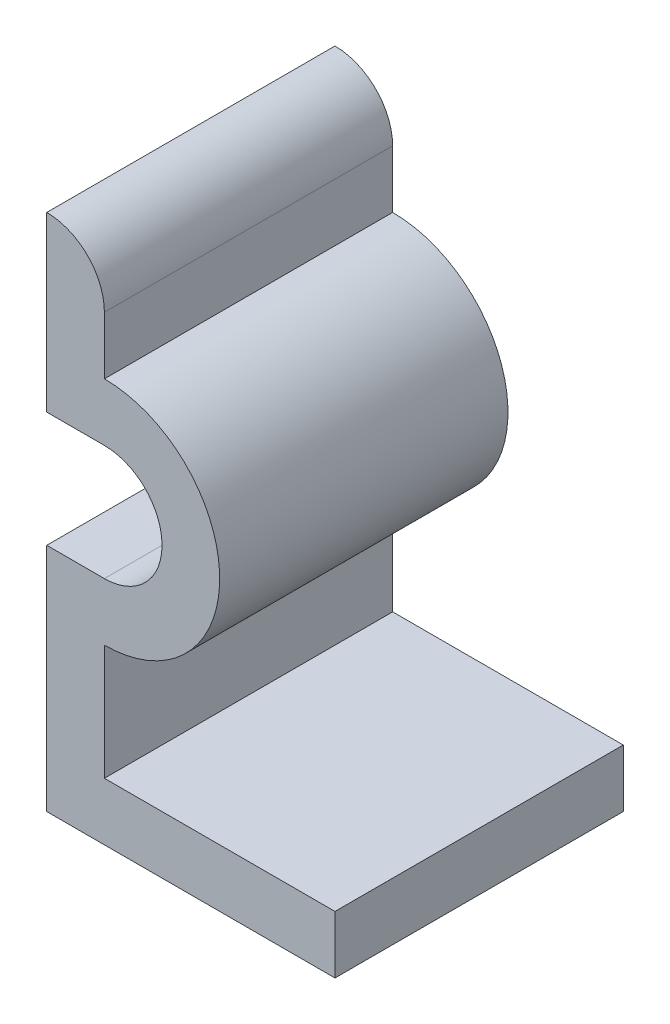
ISO-10303-21;
HEADER;
FILE_DESCRIPTION(('STEP AP214'),'2;1');
FILE_NAME('part.step','',(''),(''),'','','');
FILE_SCHEMA(('AUTOMOTIVE_DESIGN { 1 0 10303 214 1 1 1 1 }'));
ENDSEC;
DATA;
#1=APPLICATION_CONTEXT('core data for automotive mechanical design processes');
#2=APPLICATION_PROTOCOL_DEFINITION('international standard','automotive_design',2000,#1);
#3=PRODUCT_CONTEXT('',#1,'mechanical');
#4=PRODUCT('Part','Part','',(#3));
#5=PRODUCT_RELATED_PRODUCT_CATEGORY('part','',(#4));
#6=PRODUCT_DEFINITION_FORMATION('','',#4);
#7=PRODUCT_DEFINITION_CONTEXT('part definition',#1,'design');
#8=PRODUCT_DEFINITION('design','',#6,#7);
#9=PRODUCT_DEFINITION_SHAPE('','',#8);
#10=(LENGTH_UNIT() NAMED_UNIT(*) SI_UNIT(.MILLI.,.METRE.));
#11=(NAMED_UNIT(*) PLANE_ANGLE_UNIT() SI_UNIT($,.RADIAN.));
#12=(NAMED_UNIT(*) SI_UNIT($,.STERADIAN.) SOLID_ANGLE_UNIT());
#13=UNCERTAINTY_MEASURE_WITH_UNIT(LENGTH_MEASURE(1.E-05),#10,'distance_accuracy_value','');
#14=(GEOMETRIC_REPRESENTATION_CONTEXT(3) GLOBAL_UNCERTAINTY_ASSIGNED_CONTEXT((#13)) GLOBAL_UNIT_ASSIGNED_CONTEXT((#10,
#11,#12)) REPRESENTATION_CONTEXT('',''));
#15=CARTESIAN_POINT('',(0.,0.,0.));
#16=DIRECTION('',(0.,0.,1.));
#17=DIRECTION('',(1.,0.,0.));
#18=AXIS2_PLACEMENT_3D('',#15,#16,#17);
#19=CARTESIAN_POINT('',(0.,20.,12.5));
#20=DIRECTION('',(1.,0.,0.));
#21=DIRECTION('',(0.,1.,0.));
#22=AXIS2_PLACEMENT_3D('',#19,#20,#21);
#23=PLANE('',#22);
#24=DIRECTION('',(0.,-1.,0.));
#25=VECTOR('',#24,1.);
#26=CARTESIAN_POINT('',(0.,20.,-12.5));
#27=LINE('',#26,#25);
#28=CARTESIAN_POINT('',(0.,20.,-12.5));
#29=VERTEX_POINT('',#28);
#30=CARTESIAN_POINT('',(0.,0.,-12.5));
#31=VERTEX_POINT('',#30);
#32=EDGE_CURVE('E125',#29,#31,#27,.T.);
#33=ORIENTED_EDGE('',*,*,#32,.T.);
#34=DIRECTION('',(0.,0.,-1.));
#35=VECTOR('',#34,1.);
#36=CARTESIAN_POINT('',(0.,0.,12.5));
#37=LINE('',#36,#35);
#38=CARTESIAN_POINT('',(0.,0.,12.5));
#39=VERTEX_POINT('',#38);
#40=EDGE_CURVE('E11',#39,#31,#37,.T.);
#41=ORIENTED_EDGE('',*,*,#40,.F.);
#42=DIRECTION('',(0.,-1.,0.));
#43=VECTOR('',#42,1.);
#44=CARTESIAN_POINT('',(0.,20.,12.5));
#45=LINE('',#44,#43);
#46=CARTESIAN_POINT('',(0.,20.,12.5));
#47=VERTEX_POINT('',#46);
#48=EDGE_CURVE('E160',#47,#39,#45,.T.);
#49=ORIENTED_EDGE('',*,*,#48,.F.);
#50=DIRECTION('',(0.,0.,-1.));
#51=VECTOR('',#50,1.);
#52=CARTESIAN_POINT('',(0.,20.,12.5));
#53=LINE('',#52,#51);
#54=EDGE_CURVE('E138',#47,#29,#53,.T.);
#55=ORIENTED_EDGE('',*,*,#54,.T.);
#56=EDGE_LOOP('',(#33,#41,#49,#55));
#57=FACE_BOUND('',#56,.T.);
#58=ADVANCED_FACE('F33',(#57),#23,.F.);
#59=CARTESIAN_POINT('',(0.,0.,12.5));
#60=DIRECTION('',(0.,1.,0.));
#61=DIRECTION('',(0.,0.,1.));
#62=AXIS2_PLACEMENT_3D('',#59,#60,#61);
#63=PLANE('',#62);
#64=DIRECTION('',(1.,0.,0.));
#65=VECTOR('',#64,1.);
#66=CARTESIAN_POINT('',(0.,0.,-12.5));
#67=LINE('',#66,#65);
#68=CARTESIAN_POINT('',(25.,0.,-12.5));
#69=VERTEX_POINT('',#68);
#70=EDGE_CURVE('E121',#31,#69,#67,.T.);
#71=ORIENTED_EDGE('',*,*,#70,.T.);
#72=DIRECTION('',(0.,0.,-1.));
#73=VECTOR('',#72,1.);
#74=CARTESIAN_POINT('',(25.,0.,12.5));
#75=LINE('',#74,#73);
#76=CARTESIAN_POINT('',(25.,0.,12.5));
#77=VERTEX_POINT('',#76);
#78=EDGE_CURVE('E40',#77,#69,#75,.T.);
#79=ORIENTED_EDGE('',*,*,#78,.F.);
#80=DIRECTION('',(1.,0.,0.));
#81=VECTOR('',#80,1.);
#82=CARTESIAN_POINT('',(0.,0.,12.5));
#83=LINE('',#82,#81);
#84=EDGE_CURVE('E134',#39,#77,#83,.T.);
#85=ORIENTED_EDGE('',*,*,#84,.F.);
#86=ORIENTED_EDGE('',*,*,#40,.T.);
#87=EDGE_LOOP('',(#71,#79,#85,#86));
#88=FACE_BOUND('',#87,.T.);
#89=ADVANCED_FACE('F133',(#88),#63,.F.);
#90=CARTESIAN_POINT('',(25.,0.,12.5));
#91=DIRECTION('',(-1.,0.,0.));
#92=DIRECTION('',(0.,0.,1.));
#93=AXIS2_PLACEMENT_3D('',#90,#91,#92);
#94=PLANE('',#93);
#95=DIRECTION('',(0.,1.,0.));
#96=VECTOR('',#95,1.);
#97=CARTESIAN_POINT('',(25.,0.,-12.5));
#98=LINE('',#97,#96);
#99=CARTESIAN_POINT('',(25.,5.,-12.5));
#100=VERTEX_POINT('',#99);
#101=EDGE_CURVE('E127',#69,#100,#98,.T.);
#102=ORIENTED_EDGE('',*,*,#101,.T.);
#103=DIRECTION('',(0.,0.,-1.));
#104=VECTOR('',#103,1.);
#105=CARTESIAN_POINT('',(25.,5.,12.5));
#106=LINE('',#105,#104);
#107=CARTESIAN_POINT('',(25.,5.,12.5));
#108=VERTEX_POINT('',#107);
#109=EDGE_CURVE('E206',#108,#100,#106,.T.);
#110=ORIENTED_EDGE('',*,*,#109,.F.);
#111=DIRECTION('',(0.,1.,0.));
#112=VECTOR('',#111,1.);
#113=CARTESIAN_POINT('',(25.,0.,12.5));
#114=LINE('',#113,#112);
#115=EDGE_CURVE('E163',#77,#108,#114,.T.);
#116=ORIENTED_EDGE('',*,*,#115,.F.);
#117=ORIENTED_EDGE('',*,*,#78,.T.);
#118=EDGE_LOOP('',(#102,#110,#116,#117));
#119=FACE_BOUND('',#118,.T.);
#120=ADVANCED_FACE('F210',(#119),#94,.F.);
#121=CARTESIAN_POINT('',(25.,5.,12.5));
#122=DIRECTION('',(0.,-1.,0.));
#123=DIRECTION('',(1.,0.,0.));
#124=AXIS2_PLACEMENT_3D('',#121,#122,#123);
#125=PLANE('',#124);
#126=DIRECTION('',(-1.,0.,0.));
#127=VECTOR('',#126,1.);
#128=CARTESIAN_POINT('',(25.,5.,-12.5));
#129=LINE('',#128,#127);
#130=CARTESIAN_POINT('',(5.,5.,-12.5));
#131=VERTEX_POINT('',#130);
#132=EDGE_CURVE('E142',#100,#131,#129,.T.);
#133=ORIENTED_EDGE('',*,*,#132,.T.);
#134=DIRECTION('',(0.,0.,-1.));
#135=VECTOR('',#134,1.);
#136=CARTESIAN_POINT('',(5.,5.,12.5));
#137=LINE('',#136,#135);
#138=CARTESIAN_POINT('',(5.,5.,12.5));
#139=VERTEX_POINT('',#138);
#140=EDGE_CURVE('E203',#139,#131,#137,.T.);
#141=ORIENTED_EDGE('',*,*,#140,.F.);
#142=DIRECTION('',(-1.,0.,0.));
#143=VECTOR('',#142,1.);
#144=CARTESIAN_POINT('',(25.,5.,12.5));
#145=LINE('',#144,#143);
#146=EDGE_CURVE('E165',#108,#139,#145,.T.);
#147=ORIENTED_EDGE('',*,*,#146,.F.);
#148=ORIENTED_EDGE('',*,*,#109,.T.);
#149=EDGE_LOOP('',(#133,#141,#147,#148));
#150=FACE_BOUND('',#149,.T.);
#151=ADVANCED_FACE('F218',(#150),#125,.F.);
#152=CARTESIAN_POINT('',(5.,5.,12.5));
#153=DIRECTION('',(-1.,0.,0.));
#154=DIRECTION('',(0.,-1.,0.));
#155=AXIS2_PLACEMENT_3D('',#152,#153,#154);
#156=PLANE('',#155);
#157=DIRECTION('',(0.,1.,0.));
#158=VECTOR('',#157,1.);
#159=CARTESIAN_POINT('',(5.,5.,-12.5));
#160=LINE('',#159,#158);
#161=CARTESIAN_POINT('',(5.,15.,-12.5));
#162=VERTEX_POINT('',#161);
#163=EDGE_CURVE('E144',#131,#162,#160,.T.);
#164=ORIENTED_EDGE('',*,*,#163,.T.);
#165=DIRECTION('',(0.,0.,-1.));
#166=VECTOR('',#165,1.);
#167=CARTESIAN_POINT('',(5.,15.,12.5));
#168=LINE('',#167,#166);
#169=CARTESIAN_POINT('',(5.,15.,12.5));
#170=VERTEX_POINT('',#169);
#171=EDGE_CURVE('E200',#170,#162,#168,.T.);
#172=ORIENTED_EDGE('',*,*,#171,.F.);
#173=DIRECTION('',(0.,1.,0.));
#174=VECTOR('',#173,1.);
#175=CARTESIAN_POINT('',(5.,5.,12.5));
#176=LINE('',#175,#174);
#177=EDGE_CURVE('E167',#139,#170,#176,.T.);
#178=ORIENTED_EDGE('',*,*,#177,.F.);
#179=ORIENTED_EDGE('',*,*,#140,.T.);
#180=EDGE_LOOP('',(#164,#172,#178,#179));
#181=FACE_BOUND('',#180,.T.);
#182=ADVANCED_FACE('F221',(#181),#156,.F.);
#183=CARTESIAN_POINT('',(5.00000000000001,25.,12.5));
#184=DIRECTION('',(0.,0.,-1.));
#185=DIRECTION('',(-1.,0.,0.));
#186=AXIS2_PLACEMENT_3D('',#183,#184,#185);
#187=CYLINDRICAL_SURFACE('',#186,10.);
#188=CARTESIAN_POINT('',(5.00000000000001,25.,-12.5));
#189=DIRECTION('',(0.,0.,1.));
#190=DIRECTION('',(-1.,0.,0.));
#191=AXIS2_PLACEMENT_3D('',#188,#189,#190);
#192=CIRCLE('',#191,10.);
#193=CARTESIAN_POINT('',(5.00000000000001,35.,-12.5));
#194=VERTEX_POINT('',#193);
#195=EDGE_CURVE('E146',#162,#194,#192,.T.);
#196=ORIENTED_EDGE('',*,*,#195,.T.);
#197=DIRECTION('',(0.,0.,-1.));
#198=VECTOR('',#197,1.);
#199=CARTESIAN_POINT('',(5.00000000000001,35.,12.5));
#200=LINE('',#199,#198);
#201=CARTESIAN_POINT('',(5.00000000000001,35.,12.5));
#202=VERTEX_POINT('',#201);
#203=EDGE_CURVE('E197',#202,#194,#200,.T.);
#204=ORIENTED_EDGE('',*,*,#203,.F.);
#205=CARTESIAN_POINT('',(5.00000000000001,25.,12.5));
#206=DIRECTION('',(0.,0.,1.));
#207=DIRECTION('',(-1.,0.,0.));
#208=AXIS2_PLACEMENT_3D('',#205,#206,#207);
#209=CIRCLE('',#208,10.);
#210=EDGE_CURVE('E169',#170,#202,#209,.T.);
#211=ORIENTED_EDGE('',*,*,#210,.F.);
#212=ORIENTED_EDGE('',*,*,#171,.T.);
#213=EDGE_LOOP('',(#196,#204,#211,#212));
#214=FACE_BOUND('',#213,.T.);
#215=ADVANCED_FACE('F226',(#214),#187,.T.);
#216=CARTESIAN_POINT('',(5.00000000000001,35.,12.5));
#217=DIRECTION('',(-1.,0.,0.));
#218=DIRECTION('',(0.,0.,1.));
#219=AXIS2_PLACEMENT_3D('',#216,#217,#218);
#220=PLANE('',#219);
#221=DIRECTION('',(0.,1.,0.));
#222=VECTOR('',#221,1.);
#223=CARTESIAN_POINT('',(5.00000000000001,35.,-12.5));
#224=LINE('',#223,#222);
#225=CARTESIAN_POINT('',(5.00000000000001,40.,-12.5));
#226=VERTEX_POINT('',#225);
#227=EDGE_CURVE('E148',#194,#226,#224,.T.);
#228=ORIENTED_EDGE('',*,*,#227,.T.);
#229=DIRECTION('',(0.,0.,-1.));
#230=VECTOR('',#229,1.);
#231=CARTESIAN_POINT('',(5.00000000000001,40.,12.5));
#232=LINE('',#231,#230);
#233=CARTESIAN_POINT('',(5.00000000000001,40.,12.5));
#234=VERTEX_POINT('',#233);
#235=EDGE_CURVE('E194',#234,#226,#232,.T.);
#236=ORIENTED_EDGE('',*,*,#235,.F.);
#237=DIRECTION('',(0.,1.,0.));
#238=VECTOR('',#237,1.);
#239=CARTESIAN_POINT('',(5.00000000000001,35.,12.5));
#240=LINE('',#239,#238);
#241=EDGE_CURVE('E171',#202,#234,#240,.T.);
#242=ORIENTED_EDGE('',*,*,#241,.F.);
#243=ORIENTED_EDGE('',*,*,#203,.T.);
#244=EDGE_LOOP('',(#228,#236,#242,#243));
#245=FACE_BOUND('',#244,.T.);
#246=ADVANCED_FACE('F232',(#245),#220,.F.);
#247=CARTESIAN_POINT('',(0.,40.,12.5));
#248=DIRECTION('',(0.,0.,-1.));
#249=DIRECTION('',(-1.,0.,0.));
#250=AXIS2_PLACEMENT_3D('',#247,#248,#249);
#251=CYLINDRICAL_SURFACE('',#250,5.00000000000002);
#252=CARTESIAN_POINT('',(0.,40.,-12.5));
#253=DIRECTION('',(0.,0.,1.));
#254=DIRECTION('',(1.,0.,0.));
#255=AXIS2_PLACEMENT_3D('',#252,#253,#254);
#256=CIRCLE('',#255,5.00000000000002);
#257=CARTESIAN_POINT('',(0.,45.,-12.5));
#258=VERTEX_POINT('',#257);
#259=EDGE_CURVE('E150',#226,#258,#256,.T.);
#260=ORIENTED_EDGE('',*,*,#259,.T.);
#261=DIRECTION('',(0.,0.,-1.));
#262=VECTOR('',#261,1.);
#263=CARTESIAN_POINT('',(0.,45.,12.5));
#264=LINE('',#263,#262);
#265=CARTESIAN_POINT('',(0.,45.,12.5));
#266=VERTEX_POINT('',#265);
#267=EDGE_CURVE('E191',#266,#258,#264,.T.);
#268=ORIENTED_EDGE('',*,*,#267,.F.);
#269=CARTESIAN_POINT('',(0.,40.,12.5));
#270=DIRECTION('',(0.,0.,1.));
#271=DIRECTION('',(1.,0.,0.));
#272=AXIS2_PLACEMENT_3D('',#269,#270,#271);
#273=CIRCLE('',#272,5.00000000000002);
#274=EDGE_CURVE('E173',#234,#266,#273,.T.);
#275=ORIENTED_EDGE('',*,*,#274,.F.);
#276=ORIENTED_EDGE('',*,*,#235,.T.);
#277=EDGE_LOOP('',(#260,#268,#275,#276));
#278=FACE_BOUND('',#277,.T.);
#279=ADVANCED_FACE('F236',(#278),#251,.T.);
#280=CARTESIAN_POINT('',(0.,45.,12.5));
#281=DIRECTION('',(1.,0.,0.));
#282=DIRECTION('',(0.,1.,0.));
#283=AXIS2_PLACEMENT_3D('',#280,#281,#282);
#284=PLANE('',#283);
#285=DIRECTION('',(0.,-1.,0.));
#286=VECTOR('',#285,1.);
#287=CARTESIAN_POINT('',(0.,45.,-12.5));
#288=LINE('',#287,#286);
#289=CARTESIAN_POINT('',(0.,30.,-12.5));
#290=VERTEX_POINT('',#289);
#291=EDGE_CURVE('E152',#258,#290,#288,.T.);
#292=ORIENTED_EDGE('',*,*,#291,.T.);
#293=DIRECTION('',(0.,0.,-1.));
#294=VECTOR('',#293,1.);
#295=CARTESIAN_POINT('',(0.,30.,12.5));
#296=LINE('',#295,#294);
#297=CARTESIAN_POINT('',(0.,30.,12.5));
#298=VERTEX_POINT('',#297);
#299=EDGE_CURVE('E188',#298,#290,#296,.T.);
#300=ORIENTED_EDGE('',*,*,#299,.F.);
#301=DIRECTION('',(0.,-1.,0.));
#302=VECTOR('',#301,1.);
#303=CARTESIAN_POINT('',(0.,45.,12.5));
#304=LINE('',#303,#302);
#305=EDGE_CURVE('E175',#266,#298,#304,.T.);
#306=ORIENTED_EDGE('',*,*,#305,.F.);
#307=ORIENTED_EDGE('',*,*,#267,.T.);
#308=EDGE_LOOP('',(#292,#300,#306,#307));
#309=FACE_BOUND('',#308,.T.);
#310=ADVANCED_FACE('F241',(#309),#284,.F.);
#311=CARTESIAN_POINT('',(0.,30.,12.5));
#312=DIRECTION('',(0.,1.,0.));
#313=DIRECTION('',(0.,0.,1.));
#314=AXIS2_PLACEMENT_3D('',#311,#312,#313);
#315=PLANE('',#314);
#316=DIRECTION('',(1.,0.,0.));
#317=VECTOR('',#316,1.);
#318=CARTESIAN_POINT('',(0.,30.,-12.5));
#319=LINE('',#318,#317);
#320=CARTESIAN_POINT('',(5.00000000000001,30.,-12.5));
#321=VERTEX_POINT('',#320);
#322=EDGE_CURVE('E154',#290,#321,#319,.T.);
#323=ORIENTED_EDGE('',*,*,#322,.T.);
#324=DIRECTION('',(0.,0.,-1.));
#325=VECTOR('',#324,1.);
#326=CARTESIAN_POINT('',(5.00000000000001,30.,12.5));
#327=LINE('',#326,#325);
#328=CARTESIAN_POINT('',(5.00000000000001,30.,12.5));
#329=VERTEX_POINT('',#328);
#330=EDGE_CURVE('E185',#329,#321,#327,.T.);
#331=ORIENTED_EDGE('',*,*,#330,.F.);
#332=DIRECTION('',(1.,0.,0.));
#333=VECTOR('',#332,1.);
#334=CARTESIAN_POINT('',(0.,30.,12.5));
#335=LINE('',#334,#333);
#336=EDGE_CURVE('E177',#298,#329,#335,.T.);
#337=ORIENTED_EDGE('',*,*,#336,.F.);
#338=ORIENTED_EDGE('',*,*,#299,.T.);
#339=EDGE_LOOP('',(#323,#331,#337,#338));
#340=FACE_BOUND('',#339,.T.);
#341=ADVANCED_FACE('F245',(#340),#315,.F.);
#342=CARTESIAN_POINT('',(5.00000000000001,25.,12.5));
#343=DIRECTION('',(0.,0.,-1.));
#344=DIRECTION('',(-1.,0.,0.));
#345=AXIS2_PLACEMENT_3D('',#342,#343,#344);
#346=CYLINDRICAL_SURFACE('',#345,5.);
#347=CARTESIAN_POINT('',(5.00000000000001,25.,-12.5));
#348=DIRECTION('',(0.,0.,-1.));
#349=DIRECTION('',(1.,0.,0.));
#350=AXIS2_PLACEMENT_3D('',#347,#348,#349);
#351=CIRCLE('',#350,5.);
#352=CARTESIAN_POINT('',(5.00000000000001,20.,-12.5));
#353=VERTEX_POINT('',#352);
#354=EDGE_CURVE('E156',#321,#353,#351,.T.);
#355=ORIENTED_EDGE('',*,*,#354,.T.);
#356=DIRECTION('',(0.,0.,-1.));
#357=VECTOR('',#356,1.);
#358=CARTESIAN_POINT('',(5.00000000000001,20.,12.5));
#359=LINE('',#358,#357);
#360=CARTESIAN_POINT('',(5.00000000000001,20.,12.5));
#361=VERTEX_POINT('',#360);
#362=EDGE_CURVE('E182',#361,#353,#359,.T.);
#363=ORIENTED_EDGE('',*,*,#362,.F.);
#364=CARTESIAN_POINT('',(5.00000000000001,25.,12.5));
#365=DIRECTION('',(0.,0.,-1.));
#366=DIRECTION('',(1.,0.,0.));
#367=AXIS2_PLACEMENT_3D('',#364,#365,#366);
#368=CIRCLE('',#367,5.);
#369=EDGE_CURVE('E52',#329,#361,#368,.T.);
#370=ORIENTED_EDGE('',*,*,#369,.F.);
#371=ORIENTED_EDGE('',*,*,#330,.T.);
#372=EDGE_LOOP('',(#355,#363,#370,#371));
#373=FACE_BOUND('',#372,.T.);
#374=ADVANCED_FACE('F249',(#373),#346,.F.);
#375=CARTESIAN_POINT('',(0.,20.,12.5));
#376=DIRECTION('',(0.,-1.,0.));
#377=DIRECTION('',(0.,0.,-1.));
#378=AXIS2_PLACEMENT_3D('',#375,#376,#377);
#379=PLANE('',#378);
#380=DIRECTION('',(-1.,0.,0.));
#381=VECTOR('',#380,1.);
#382=CARTESIAN_POINT('',(0.,20.,-12.5));
#383=LINE('',#382,#381);
#384=EDGE_CURVE('E158',#353,#29,#383,.T.);
#385=ORIENTED_EDGE('',*,*,#384,.T.);
#386=ORIENTED_EDGE('',*,*,#54,.F.);
#387=DIRECTION('',(-1.,0.,0.));
#388=VECTOR('',#387,1.);
#389=CARTESIAN_POINT('',(0.,20.,12.5));
#390=LINE('',#389,#388);
#391=EDGE_CURVE('E47',#361,#47,#390,.T.);
#392=ORIENTED_EDGE('',*,*,#391,.F.);
#393=ORIENTED_EDGE('',*,*,#362,.T.);
#394=EDGE_LOOP('',(#385,#386,#392,#393));
#395=FACE_BOUND('',#394,.T.);
#396=ADVANCED_FACE('F251',(#395),#379,.F.);
#397=CARTESIAN_POINT('',(5.00000000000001,25.,12.5));
#398=DIRECTION('',(0.,0.,-1.));
#399=DIRECTION('',(-1.,0.,0.));
#400=AXIS2_PLACEMENT_3D('',#397,#398,#399);
#401=PLANE('',#400);
#402=ORIENTED_EDGE('',*,*,#48,.T.);
#403=ORIENTED_EDGE('',*,*,#84,.T.);
#404=ORIENTED_EDGE('',*,*,#115,.T.);
#405=ORIENTED_EDGE('',*,*,#146,.T.);
#406=ORIENTED_EDGE('',*,*,#177,.T.);
#407=ORIENTED_EDGE('',*,*,#210,.T.);
#408=ORIENTED_EDGE('',*,*,#241,.T.);
#409=ORIENTED_EDGE('',*,*,#274,.T.);
#410=ORIENTED_EDGE('',*,*,#305,.T.);
#411=ORIENTED_EDGE('',*,*,#336,.T.);
#412=ORIENTED_EDGE('',*,*,#369,.T.);
#413=ORIENTED_EDGE('',*,*,#391,.T.);
#414=EDGE_LOOP('',(#402,#403,#404,#405,#406,#407,#408,#409,#410,#411,#412,#413));
#415=FACE_BOUND('',#414,.T.);
#416=ADVANCED_FACE('F213',(#415),#401,.F.);
#417=CARTESIAN_POINT('',(5.00000000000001,25.,-12.5));
#418=DIRECTION('',(0.,0.,-1.));
#419=DIRECTION('',(-1.,0.,0.));
#420=AXIS2_PLACEMENT_3D('',#417,#418,#419);
#421=PLANE('',#420);
#422=ORIENTED_EDGE('',*,*,#32,.F.);
#423=ORIENTED_EDGE('',*,*,#384,.F.);
#424=ORIENTED_EDGE('',*,*,#354,.F.);
#425=ORIENTED_EDGE('',*,*,#322,.F.);
#426=ORIENTED_EDGE('',*,*,#291,.F.);
#427=ORIENTED_EDGE('',*,*,#259,.F.);
#428=ORIENTED_EDGE('',*,*,#227,.F.);
#429=ORIENTED_EDGE('',*,*,#195,.F.);
#430=ORIENTED_EDGE('',*,*,#163,.F.);
#431=ORIENTED_EDGE('',*,*,#132,.F.);
#432=ORIENTED_EDGE('',*,*,#101,.F.);
#433=ORIENTED_EDGE('',*,*,#70,.F.);
#434=EDGE_LOOP('',(#422,#423,#424,#425,#426,#427,#428,#429,#430,#431,#432,#433));
#435=FACE_BOUND('',#434,.T.);
#436=ADVANCED_FACE('F122',(#435),#421,.T.);
#437=CLOSED_SHELL('',(#58,#89,#120,#151,#182,#215,#246,#279,#310,#341,#374,#396,#416,#436));
#438=MANIFOLD_SOLID_BREP('B2',#437);
#439=ADVANCED_BREP_SHAPE_REPRESENTATION('',(#18,#438),#14);
#440=SHAPE_DEFINITION_REPRESENTATION(#9,#439);
ENDSEC;
END-ISO-10303-21;
